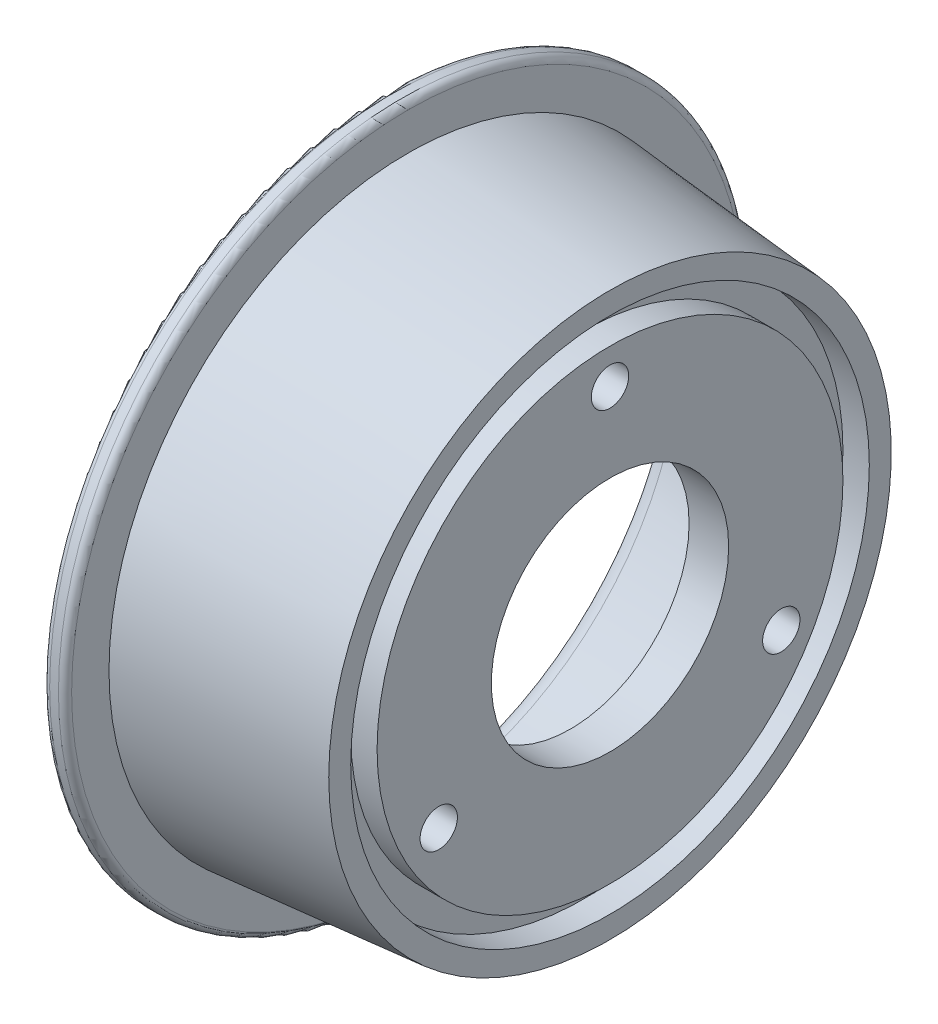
ISO-10303-21;
HEADER;
FILE_DESCRIPTION(('STEP AP214'),'2;1');
FILE_NAME('part.step','',(''),(''),'','','');
FILE_SCHEMA(('AUTOMOTIVE_DESIGN { 1 0 10303 214 1 1 1 1 }'));
ENDSEC;
DATA;
#1=APPLICATION_CONTEXT('core data for automotive mechanical design processes');
#2=APPLICATION_PROTOCOL_DEFINITION('international standard','automotive_design',2000,#1);
#3=PRODUCT_CONTEXT('',#1,'mechanical');
#4=PRODUCT('Part','Part','',(#3));
#5=PRODUCT_RELATED_PRODUCT_CATEGORY('part','',(#4));
#6=PRODUCT_DEFINITION_FORMATION('','',#4);
#7=PRODUCT_DEFINITION_CONTEXT('part definition',#1,'design');
#8=PRODUCT_DEFINITION('design','',#6,#7);
#9=PRODUCT_DEFINITION_SHAPE('','',#8);
#10=(LENGTH_UNIT() NAMED_UNIT(*) SI_UNIT(.MILLI.,.METRE.));
#11=(NAMED_UNIT(*) PLANE_ANGLE_UNIT() SI_UNIT($,.RADIAN.));
#12=(NAMED_UNIT(*) SI_UNIT($,.STERADIAN.) SOLID_ANGLE_UNIT());
#13=UNCERTAINTY_MEASURE_WITH_UNIT(LENGTH_MEASURE(1.E-05),#10,'distance_accuracy_value','');
#14=(GEOMETRIC_REPRESENTATION_CONTEXT(3) GLOBAL_UNCERTAINTY_ASSIGNED_CONTEXT((#13)) GLOBAL_UNIT_ASSIGNED_CONTEXT((#10,
#11,#12)) REPRESENTATION_CONTEXT('',''));
#15=CARTESIAN_POINT('',(0.,0.,0.));
#16=DIRECTION('',(0.,0.,1.));
#17=DIRECTION('',(1.,0.,0.));
#18=AXIS2_PLACEMENT_3D('',#15,#16,#17);
#19=CARTESIAN_POINT('',(-57.1924668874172,5.80662251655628,0.));
#20=DIRECTION('',(1.,0.,0.));
#21=DIRECTION('',(0.,0.,-1.));
#22=AXIS2_PLACEMENT_3D('',#19,#20,#21);
#23=PLANE('',#22);
#24=CARTESIAN_POINT('',(-57.1924668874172,-8.69337748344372,6.45317133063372E-13));
#25=DIRECTION('',(1.,0.,0.));
#26=DIRECTION('',(0.,0.,-1.));
#27=AXIS2_PLACEMENT_3D('',#24,#25,#26);
#28=CIRCLE('',#27,4.25000000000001);
#29=CARTESIAN_POINT('',(-57.1924668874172,-8.69337748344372,-4.24999999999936));
#30=VERTEX_POINT('',#29);
#31=EDGE_CURVE('E96',#30,#30,#28,.T.);
#32=ORIENTED_EDGE('',*,*,#31,.T.);
#33=EDGE_LOOP('',(#32));
#34=FACE_BOUND('',#33,.T.);
#35=CARTESIAN_POINT('',(-57.1924668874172,-76.1933774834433,-38.9711431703));
#36=DIRECTION('',(1.,0.,0.));
#37=DIRECTION('',(0.,0.,-1.));
#38=AXIS2_PLACEMENT_3D('',#35,#36,#37);
#39=CIRCLE('',#38,4.25000000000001);
#40=CARTESIAN_POINT('',(-57.1924668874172,-76.1933774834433,-43.2211431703));
#41=VERTEX_POINT('',#40);
#42=EDGE_CURVE('E90',#41,#41,#39,.T.);
#43=ORIENTED_EDGE('',*,*,#42,.T.);
#44=EDGE_LOOP('',(#43));
#45=FACE_BOUND('',#44,.T.);
#46=CARTESIAN_POINT('',(-57.1924668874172,-76.1933774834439,38.9711431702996));
#47=DIRECTION('',(1.,0.,0.));
#48=DIRECTION('',(0.,0.,-1.));
#49=AXIS2_PLACEMENT_3D('',#46,#47,#48);
#50=CIRCLE('',#49,4.25000000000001);
#51=CARTESIAN_POINT('',(-57.1924668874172,-76.1933774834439,34.7211431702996));
#52=VERTEX_POINT('',#51);
#53=EDGE_CURVE('E84',#52,#52,#50,.T.);
#54=ORIENTED_EDGE('',*,*,#53,.T.);
#55=EDGE_LOOP('',(#54));
#56=FACE_BOUND('',#55,.T.);
#57=CARTESIAN_POINT('',(-57.1924668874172,-53.6933774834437,0.));
#58=DIRECTION('',(1.,0.,0.));
#59=DIRECTION('',(0.,0.,-1.));
#60=AXIS2_PLACEMENT_3D('',#57,#58,#59);
#61=CIRCLE('',#60,27.);
#62=CARTESIAN_POINT('',(-57.1924668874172,-53.6933774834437,-27.));
#63=VERTEX_POINT('',#62);
#64=EDGE_CURVE('E78',#63,#63,#61,.T.);
#65=ORIENTED_EDGE('',*,*,#64,.T.);
#66=EDGE_LOOP('',(#65));
#67=FACE_BOUND('',#66,.T.);
#68=CARTESIAN_POINT('',(-57.1924668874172,-53.6933774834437,0.));
#69=DIRECTION('',(-1.,0.,0.));
#70=DIRECTION('',(0.,0.,1.));
#71=AXIS2_PLACEMENT_3D('',#68,#69,#70);
#72=CIRCLE('',#71,59.5);
#73=CARTESIAN_POINT('',(-57.1924668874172,-53.6933774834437,59.5));
#74=VERTEX_POINT('',#73);
#75=EDGE_CURVE('E75',#74,#74,#72,.T.);
#76=ORIENTED_EDGE('',*,*,#75,.T.);
#77=EDGE_LOOP('',(#76));
#78=FACE_BOUND('',#77,.T.);
#79=ADVANCED_FACE('F32',(#34,#45,#56,#67,#78),#23,.F.);
#80=CARTESIAN_POINT('',(-48.1924668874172,-53.6933774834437,0.));
#81=DIRECTION('',(-1.,0.,0.));
#82=DIRECTION('',(0.,0.,1.));
#83=AXIS2_PLACEMENT_3D('',#80,#81,#82);
#84=PLANE('',#83);
#85=CARTESIAN_POINT('',(-48.1924668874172,-8.69337748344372,6.45317133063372E-13));
#86=DIRECTION('',(1.,0.,0.));
#87=DIRECTION('',(0.,-0.866025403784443,0.499999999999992));
#88=AXIS2_PLACEMENT_3D('',#85,#86,#87);
#89=CIRCLE('',#88,4.25000000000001);
#90=CARTESIAN_POINT('',(-48.1924668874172,-12.3739854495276,2.12500000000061));
#91=VERTEX_POINT('',#90);
#92=EDGE_CURVE('E99',#91,#91,#89,.T.);
#93=ORIENTED_EDGE('',*,*,#92,.F.);
#94=EDGE_LOOP('',(#93));
#95=FACE_BOUND('',#94,.T.);
#96=CARTESIAN_POINT('',(-48.1924668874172,-76.1933774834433,-38.9711431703));
#97=DIRECTION('',(1.,0.,0.));
#98=DIRECTION('',(0.,0.866025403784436,0.500000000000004));
#99=AXIS2_PLACEMENT_3D('',#96,#97,#98);
#100=CIRCLE('',#99,4.25000000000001);
#101=CARTESIAN_POINT('',(-48.1924668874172,-72.5127695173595,-36.8461431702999));
#102=VERTEX_POINT('',#101);
#103=EDGE_CURVE('E93',#102,#102,#100,.T.);
#104=ORIENTED_EDGE('',*,*,#103,.F.);
#105=EDGE_LOOP('',(#104));
#106=FACE_BOUND('',#105,.T.);
#107=CARTESIAN_POINT('',(-48.1924668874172,-76.1933774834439,38.9711431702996));
#108=DIRECTION('',(1.,0.,0.));
#109=DIRECTION('',(0.,0.,-1.));
#110=AXIS2_PLACEMENT_3D('',#107,#108,#109);
#111=CIRCLE('',#110,4.25000000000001);
#112=CARTESIAN_POINT('',(-48.1924668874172,-76.1933774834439,34.7211431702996));
#113=VERTEX_POINT('',#112);
#114=EDGE_CURVE('E87',#113,#113,#111,.T.);
#115=ORIENTED_EDGE('',*,*,#114,.F.);
#116=EDGE_LOOP('',(#115));
#117=FACE_BOUND('',#116,.T.);
#118=CARTESIAN_POINT('',(-48.1924668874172,-53.6933774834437,0.));
#119=DIRECTION('',(1.,0.,0.));
#120=DIRECTION('',(0.,0.,-1.));
#121=AXIS2_PLACEMENT_3D('',#118,#119,#120);
#122=CIRCLE('',#121,27.);
#123=CARTESIAN_POINT('',(-48.1924668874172,-53.6933774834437,-27.));
#124=VERTEX_POINT('',#123);
#125=EDGE_CURVE('E81',#124,#124,#122,.T.);
#126=ORIENTED_EDGE('',*,*,#125,.F.);
#127=EDGE_LOOP('',(#126));
#128=FACE_BOUND('',#127,.T.);
#129=CARTESIAN_POINT('',(-48.1924668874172,-53.6933774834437,0.));
#130=DIRECTION('',(-1.,0.,0.));
#131=DIRECTION('',(0.,0.,1.));
#132=AXIS2_PLACEMENT_3D('',#129,#130,#131);
#133=CIRCLE('',#132,53.);
#134=CARTESIAN_POINT('',(-48.1924668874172,-53.6933774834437,53.));
#135=VERTEX_POINT('',#134);
#136=EDGE_CURVE('E10',#135,#135,#133,.T.);
#137=ORIENTED_EDGE('',*,*,#136,.F.);
#138=EDGE_LOOP('',(#137));
#139=FACE_BOUND('',#138,.T.);
#140=ADVANCED_FACE('F106',(#95,#106,#117,#128,#139),#84,.F.);
#141=CARTESIAN_POINT('',(-48.1924668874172,-53.6933774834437,0.));
#142=DIRECTION('',(-1.,0.,0.));
#143=DIRECTION('',(0.,0.,1.));
#144=AXIS2_PLACEMENT_3D('',#141,#142,#143);
#145=CYLINDRICAL_SURFACE('',#144,53.);
#146=ORIENTED_EDGE('',*,*,#136,.T.);
#147=EDGE_LOOP('',(#146));
#148=FACE_BOUND('',#147,.T.);
#149=CARTESIAN_POINT('',(-54.1924668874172,-53.6933774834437,0.));
#150=DIRECTION('',(-1.,0.,0.));
#151=DIRECTION('',(0.,0.,1.));
#152=AXIS2_PLACEMENT_3D('',#149,#150,#151);
#153=CIRCLE('',#152,53.);
#154=CARTESIAN_POINT('',(-54.1924668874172,-53.6933774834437,53.));
#155=VERTEX_POINT('',#154);
#156=EDGE_CURVE('E38',#155,#155,#153,.T.);
#157=ORIENTED_EDGE('',*,*,#156,.F.);
#158=EDGE_LOOP('',(#157));
#159=FACE_BOUND('',#158,.T.);
#160=ADVANCED_FACE('F109',(#148,#159),#145,.T.);
#161=CARTESIAN_POINT('',(-54.1924668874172,5.3066225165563,0.));
#162=DIRECTION('',(1.,0.,0.));
#163=DIRECTION('',(0.,0.,-1.));
#164=AXIS2_PLACEMENT_3D('',#161,#162,#163);
#165=PLANE('',#164);
#166=ORIENTED_EDGE('',*,*,#156,.T.);
#167=EDGE_LOOP('',(#166));
#168=FACE_BOUND('',#167,.T.);
#169=CARTESIAN_POINT('',(-54.1924668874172,-53.6933774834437,0.));
#170=DIRECTION('',(-1.,0.,0.));
#171=DIRECTION('',(0.,0.,1.));
#172=AXIS2_PLACEMENT_3D('',#169,#170,#171);
#173=CIRCLE('',#172,59.);
#174=CARTESIAN_POINT('',(-54.1924668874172,-53.6933774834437,59.));
#175=VERTEX_POINT('',#174);
#176=EDGE_CURVE('E42',#175,#175,#173,.T.);
#177=ORIENTED_EDGE('',*,*,#176,.F.);
#178=EDGE_LOOP('',(#177));
#179=FACE_BOUND('',#178,.T.);
#180=ADVANCED_FACE('F172',(#168,#179),#165,.T.);
#181=CARTESIAN_POINT('',(-48.1924668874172,-53.6933774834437,0.));
#182=DIRECTION('',(-1.,0.,0.));
#183=DIRECTION('',(0.,0.,1.));
#184=AXIS2_PLACEMENT_3D('',#181,#182,#183);
#185=CYLINDRICAL_SURFACE('',#184,59.);
#186=ORIENTED_EDGE('',*,*,#176,.T.);
#187=EDGE_LOOP('',(#186));
#188=FACE_BOUND('',#187,.T.);
#189=CARTESIAN_POINT('',(-48.1924668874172,-53.6933774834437,0.));
#190=DIRECTION('',(-1.,0.,0.));
#191=DIRECTION('',(0.,0.,1.));
#192=AXIS2_PLACEMENT_3D('',#189,#190,#191);
#193=CIRCLE('',#192,59.);
#194=CARTESIAN_POINT('',(-48.1924668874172,-53.6933774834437,59.));
#195=VERTEX_POINT('',#194);
#196=EDGE_CURVE('E46',#195,#195,#193,.T.);
#197=ORIENTED_EDGE('',*,*,#196,.F.);
#198=EDGE_LOOP('',(#197));
#199=FACE_BOUND('',#198,.T.);
#200=ADVANCED_FACE('F168',(#188,#199),#185,.F.);
#201=CARTESIAN_POINT('',(-48.1924668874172,5.30662251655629,0.));
#202=DIRECTION('',(-1.,0.,0.));
#203=DIRECTION('',(0.,0.,1.));
#204=AXIS2_PLACEMENT_3D('',#201,#202,#203);
#205=PLANE('',#204);
#206=CARTESIAN_POINT('',(-48.1924668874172,-53.6933774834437,0.));
#207=DIRECTION('',(-1.,0.,0.));
#208=DIRECTION('',(0.,0.,1.));
#209=AXIS2_PLACEMENT_3D('',#206,#207,#208);
#210=CIRCLE('',#209,64.);
#211=CARTESIAN_POINT('',(-48.1924668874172,-53.6933774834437,64.));
#212=VERTEX_POINT('',#211);
#213=EDGE_CURVE('E51',#212,#212,#210,.T.);
#214=ORIENTED_EDGE('',*,*,#213,.F.);
#215=EDGE_LOOP('',(#214));
#216=FACE_BOUND('',#215,.T.);
#217=ORIENTED_EDGE('',*,*,#196,.T.);
#218=EDGE_LOOP('',(#217));
#219=FACE_BOUND('',#218,.T.);
#220=ADVANCED_FACE('F164',(#216,#219),#205,.F.);
#221=CARTESIAN_POINT('',(-94.1924668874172,-53.6933774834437,0.));
#222=DIRECTION('',(-1.,0.,0.));
#223=DIRECTION('',(0.,0.,1.));
#224=AXIS2_PLACEMENT_3D('',#221,#222,#223);
#225=CONICAL_SURFACE('',#224,68.,0.0867383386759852);
#226=ORIENTED_EDGE('',*,*,#213,.T.);
#227=EDGE_LOOP('',(#226));
#228=FACE_BOUND('',#227,.T.);
#229=CARTESIAN_POINT('',(-94.1924668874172,-53.6933774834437,0.));
#230=DIRECTION('',(-1.,0.,0.));
#231=DIRECTION('',(0.,0.,1.));
#232=AXIS2_PLACEMENT_3D('',#229,#230,#231);
#233=CIRCLE('',#232,68.);
#234=CARTESIAN_POINT('',(-94.1924668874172,-53.6933774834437,68.));
#235=VERTEX_POINT('',#234);
#236=EDGE_CURVE('E54',#235,#235,#233,.T.);
#237=ORIENTED_EDGE('',*,*,#236,.F.);
#238=EDGE_LOOP('',(#237));
#239=FACE_BOUND('',#238,.T.);
#240=ADVANCED_FACE('F160',(#228,#239),#225,.T.);
#241=CARTESIAN_POINT('',(-94.1924668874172,22.8066225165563,0.));
#242=DIRECTION('',(1.,0.,0.));
#243=DIRECTION('',(0.,0.,-1.));
#244=AXIS2_PLACEMENT_3D('',#241,#242,#243);
#245=PLANE('',#244);
#246=ORIENTED_EDGE('',*,*,#236,.T.);
#247=EDGE_LOOP('',(#246));
#248=FACE_BOUND('',#247,.T.);
#249=CARTESIAN_POINT('',(-94.1924668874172,-53.6933774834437,0.));
#250=DIRECTION('',(-1.,0.,0.));
#251=DIRECTION('',(0.,0.,1.));
#252=AXIS2_PLACEMENT_3D('',#249,#250,#251);
#253=CIRCLE('',#252,76.5);
#254=CARTESIAN_POINT('',(-94.1924668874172,-53.6933774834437,76.5));
#255=VERTEX_POINT('',#254);
#256=EDGE_CURVE('E57',#255,#255,#253,.T.);
#257=ORIENTED_EDGE('',*,*,#256,.F.);
#258=EDGE_LOOP('',(#257));
#259=FACE_BOUND('',#258,.T.);
#260=ADVANCED_FACE('F156',(#248,#259),#245,.T.);
#261=CARTESIAN_POINT('',(-95.6924668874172,-53.6933774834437,0.));
#262=DIRECTION('',(-1.,0.,0.));
#263=DIRECTION('',(0.,0.,1.));
#264=AXIS2_PLACEMENT_3D('',#261,#262,#263);
#265=TOROIDAL_SURFACE('',#264,76.5,1.5);
#266=CARTESIAN_POINT('',(-95.6924668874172,-53.6933774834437,0.));
#267=DIRECTION('',(-1.,0.,0.));
#268=DIRECTION('',(0.,0.,1.));
#269=AXIS2_PLACEMENT_3D('',#266,#267,#268);
#270=CIRCLE('',#269,78.);
#271=CARTESIAN_POINT('',(-95.6924668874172,-53.6933774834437,78.));
#272=VERTEX_POINT('',#271);
#273=EDGE_CURVE('E60',#272,#272,#270,.T.);
#274=ORIENTED_EDGE('',*,*,#273,.F.);
#275=EDGE_LOOP('',(#274));
#276=FACE_BOUND('',#275,.T.);
#277=ORIENTED_EDGE('',*,*,#256,.T.);
#278=EDGE_LOOP('',(#277));
#279=FACE_BOUND('',#278,.T.);
#280=ADVANCED_FACE('F152',(#276,#279),#265,.T.);
#281=CARTESIAN_POINT('',(-48.1924668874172,-53.6933774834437,0.));
#282=DIRECTION('',(-1.,0.,0.));
#283=DIRECTION('',(0.,0.,1.));
#284=AXIS2_PLACEMENT_3D('',#281,#282,#283);
#285=CYLINDRICAL_SURFACE('',#284,78.);
#286=ORIENTED_EDGE('',*,*,#273,.T.);
#287=EDGE_LOOP('',(#286));
#288=FACE_BOUND('',#287,.T.);
#289=CARTESIAN_POINT('',(-97.6924668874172,-53.6933774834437,0.));
#290=DIRECTION('',(-1.,0.,0.));
#291=DIRECTION('',(0.,0.,1.));
#292=AXIS2_PLACEMENT_3D('',#289,#290,#291);
#293=CIRCLE('',#292,78.);
#294=CARTESIAN_POINT('',(-97.6924668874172,-53.6933774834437,78.));
#295=VERTEX_POINT('',#294);
#296=EDGE_CURVE('E63',#295,#295,#293,.T.);
#297=ORIENTED_EDGE('',*,*,#296,.F.);
#298=EDGE_LOOP('',(#297));
#299=FACE_BOUND('',#298,.T.);
#300=ADVANCED_FACE('F148',(#288,#299),#285,.T.);
#301=CARTESIAN_POINT('',(-97.6924668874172,-53.6933774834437,0.));
#302=DIRECTION('',(-1.,0.,0.));
#303=DIRECTION('',(0.,0.,1.));
#304=AXIS2_PLACEMENT_3D('',#301,#302,#303);
#305=TOROIDAL_SURFACE('',#304,76.5,1.5);
#306=CARTESIAN_POINT('',(-99.1924668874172,-53.6933774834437,0.));
#307=DIRECTION('',(-1.,0.,0.));
#308=DIRECTION('',(0.,0.,1.));
#309=AXIS2_PLACEMENT_3D('',#306,#307,#308);
#310=CIRCLE('',#309,76.5);
#311=CARTESIAN_POINT('',(-99.1924668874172,-53.6933774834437,76.5));
#312=VERTEX_POINT('',#311);
#313=EDGE_CURVE('E66',#312,#312,#310,.T.);
#314=ORIENTED_EDGE('',*,*,#313,.F.);
#315=EDGE_LOOP('',(#314));
#316=FACE_BOUND('',#315,.T.);
#317=ORIENTED_EDGE('',*,*,#296,.T.);
#318=EDGE_LOOP('',(#317));
#319=FACE_BOUND('',#318,.T.);
#320=ADVANCED_FACE('F144',(#316,#319),#305,.T.);
#321=CARTESIAN_POINT('',(-99.1924668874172,13.9072869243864,0.));
#322=DIRECTION('',(-1.,0.,0.));
#323=DIRECTION('',(0.,0.,1.));
#324=AXIS2_PLACEMENT_3D('',#321,#322,#323);
#325=PLANE('',#324);
#326=ORIENTED_EDGE('',*,*,#313,.T.);
#327=EDGE_LOOP('',(#326));
#328=FACE_BOUND('',#327,.T.);
#329=CARTESIAN_POINT('',(-99.1924668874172,-53.6933774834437,0.));
#330=DIRECTION('',(-1.,0.,0.));
#331=DIRECTION('',(0.,0.,1.));
#332=AXIS2_PLACEMENT_3D('',#329,#330,#331);
#333=CIRCLE('',#332,67.6006644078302);
#334=CARTESIAN_POINT('',(-99.1924668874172,-53.6933774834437,67.6006644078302));
#335=VERTEX_POINT('',#334);
#336=EDGE_CURVE('E69',#335,#335,#333,.T.);
#337=ORIENTED_EDGE('',*,*,#336,.F.);
#338=EDGE_LOOP('',(#337));
#339=FACE_BOUND('',#338,.T.);
#340=ADVANCED_FACE('F137',(#328,#339),#325,.T.);
#341=CARTESIAN_POINT('',(-94.1924668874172,-53.6933774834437,0.));
#342=DIRECTION('',(-1.,0.,0.));
#343=DIRECTION('',(0.,0.,1.));
#344=AXIS2_PLACEMENT_3D('',#341,#342,#343);
#345=TOROIDAL_SURFACE('',#344,67.6006644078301,5.);
#346=CARTESIAN_POINT('',(-94.6076942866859,-53.6933774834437,0.));
#347=DIRECTION('',(-1.,0.,0.));
#348=DIRECTION('',(0.,0.,1.));
#349=AXIS2_PLACEMENT_3D('',#346,#347,#348);
#350=CIRCLE('',#349,62.6179356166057);
#351=CARTESIAN_POINT('',(-94.6076942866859,-53.6933774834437,62.6179356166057));
#352=VERTEX_POINT('',#351);
#353=EDGE_CURVE('E72',#352,#352,#350,.T.);
#354=ORIENTED_EDGE('',*,*,#353,.F.);
#355=EDGE_LOOP('',(#354));
#356=FACE_BOUND('',#355,.T.);
#357=ORIENTED_EDGE('',*,*,#336,.T.);
#358=EDGE_LOOP('',(#357));
#359=FACE_BOUND('',#358,.T.);
#360=ADVANCED_FACE('F131',(#356,#359),#345,.T.);
#361=CARTESIAN_POINT('',(-57.1924668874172,-53.6933774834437,0.));
#362=DIRECTION('',(-1.,0.,0.));
#363=DIRECTION('',(0.,0.,1.));
#364=AXIS2_PLACEMENT_3D('',#361,#362,#363);
#365=CONICAL_SURFACE('',#364,59.5,0.0831412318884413);
#366=ORIENTED_EDGE('',*,*,#353,.T.);
#367=EDGE_LOOP('',(#366));
#368=FACE_BOUND('',#367,.T.);
#369=ORIENTED_EDGE('',*,*,#75,.F.);
#370=EDGE_LOOP('',(#369));
#371=FACE_BOUND('',#370,.T.);
#372=ADVANCED_FACE('F121',(#368,#371),#365,.F.);
#373=CARTESIAN_POINT('',(-99.1924668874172,-53.6933774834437,0.));
#374=DIRECTION('',(1.,0.,0.));
#375=DIRECTION('',(0.,0.,-1.));
#376=AXIS2_PLACEMENT_3D('',#373,#374,#375);
#377=CYLINDRICAL_SURFACE('',#376,27.);
#378=ORIENTED_EDGE('',*,*,#125,.T.);
#379=EDGE_LOOP('',(#378));
#380=FACE_BOUND('',#379,.T.);
#381=ORIENTED_EDGE('',*,*,#64,.F.);
#382=EDGE_LOOP('',(#381));
#383=FACE_BOUND('',#382,.T.);
#384=ADVANCED_FACE('F117',(#380,#383),#377,.F.);
#385=CARTESIAN_POINT('',(-99.1924668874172,-76.1933774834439,38.9711431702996));
#386=DIRECTION('',(1.,0.,0.));
#387=DIRECTION('',(0.,0.,-1.));
#388=AXIS2_PLACEMENT_3D('',#385,#386,#387);
#389=CYLINDRICAL_SURFACE('',#388,4.25000000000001);
#390=ORIENTED_EDGE('',*,*,#114,.T.);
#391=EDGE_LOOP('',(#390));
#392=FACE_BOUND('',#391,.T.);
#393=ORIENTED_EDGE('',*,*,#53,.F.);
#394=EDGE_LOOP('',(#393));
#395=FACE_BOUND('',#394,.T.);
#396=ADVANCED_FACE('F120',(#392,#395),#389,.F.);
#397=CARTESIAN_POINT('',(-99.1924668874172,-76.1933774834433,-38.9711431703));
#398=DIRECTION('',(1.,0.,0.));
#399=DIRECTION('',(0.,0.,-1.));
#400=AXIS2_PLACEMENT_3D('',#397,#398,#399);
#401=CYLINDRICAL_SURFACE('',#400,4.25000000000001);
#402=ORIENTED_EDGE('',*,*,#103,.T.);
#403=EDGE_LOOP('',(#402));
#404=FACE_BOUND('',#403,.T.);
#405=ORIENTED_EDGE('',*,*,#42,.F.);
#406=EDGE_LOOP('',(#405));
#407=FACE_BOUND('',#406,.T.);
#408=ADVANCED_FACE('F243',(#404,#407),#401,.F.);
#409=CARTESIAN_POINT('',(-99.1924668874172,-8.69337748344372,6.45317133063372E-13));
#410=DIRECTION('',(1.,0.,0.));
#411=DIRECTION('',(0.,0.,-1.));
#412=AXIS2_PLACEMENT_3D('',#409,#410,#411);
#413=CYLINDRICAL_SURFACE('',#412,4.25000000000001);
#414=ORIENTED_EDGE('',*,*,#92,.T.);
#415=EDGE_LOOP('',(#414));
#416=FACE_BOUND('',#415,.T.);
#417=ORIENTED_EDGE('',*,*,#31,.F.);
#418=EDGE_LOOP('',(#417));
#419=FACE_BOUND('',#418,.T.);
#420=ADVANCED_FACE('F103',(#416,#419),#413,.F.);
#421=CLOSED_SHELL('',(#79,#140,#160,#180,#200,#220,#240,#260,#280,#300,#320,#340,#360,#372,#384,
#396,#408,#420));
#422=MANIFOLD_SOLID_BREP('B2',#421);
#423=ADVANCED_BREP_SHAPE_REPRESENTATION('',(#18,#422),#14);
#424=SHAPE_DEFINITION_REPRESENTATION(#9,#423);
ENDSEC;
END-ISO-10303-21;
